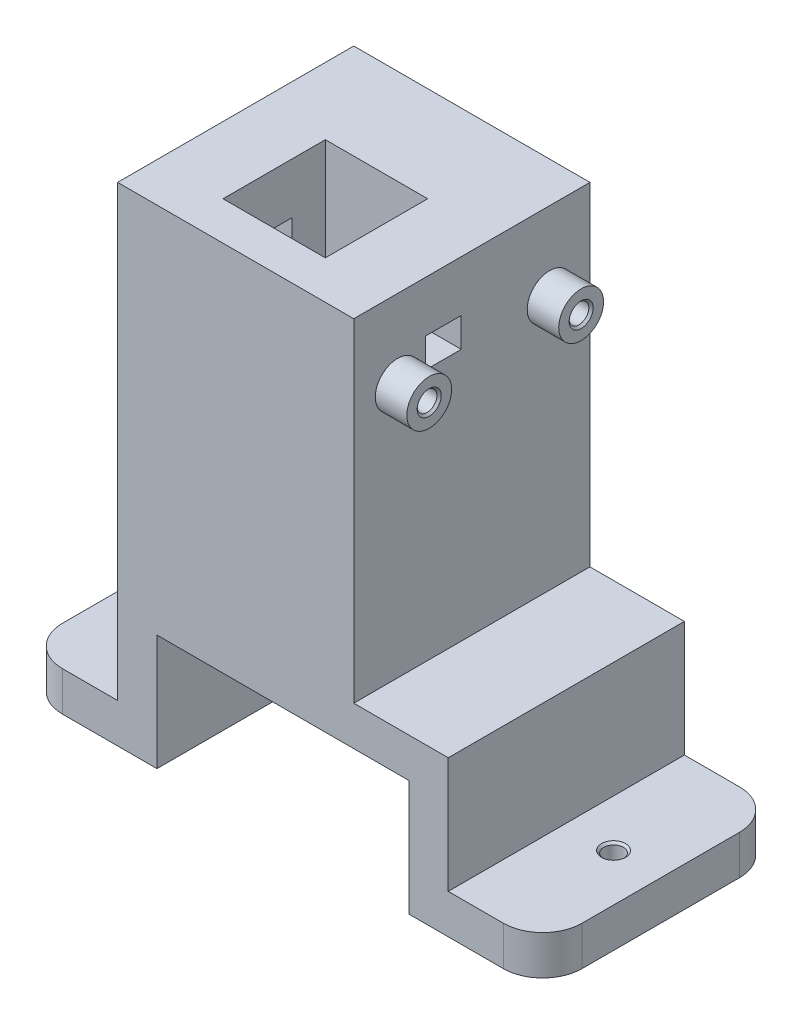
from build123d import *

# Parameters (mm, degrees)
EXTRUDE_1_DEPTH              = 30
SKETCH_2_R                   = 2.85
EXTRUDE_2_DEPTH              = 4
SKETCH_4_W                   = 13
SKETCH_4_H                   = 13
CUT_EXTRUDE_1_DEPTH          = 30
SKETCH_3_W                   = 4.524721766
SKETCH_3_H                   = 3.732895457
CUT_EXTRUDE_2_DEPTH          = 63
HOLE_WIZARD_M3_1_D           = 2.5
HOLE_WIZARD_M3_1_CSINK_D     = 3.05
HOLE_WIZARD_M3_1_CSINK_ANGLE = 90
HOLE_WIZARD_M3_2_D           = 2.5
HOLE_WIZARD_M3_2_DEPTH       = 11.6
HOLE_WIZARD_M3_2_CSINK_D     = 3.05
HOLE_WIZARD_M3_2_CSINK_ANGLE = 90
HOLE_WIZARD_M3_2_TIP         = 0.751075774
FILLET_2_R                   = 5


with BuildPart() as part:
    # Sketch 1 → Extrude 1 (new body)
    with BuildSketch(Plane.XY):
        Polygon((-17.535282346, 24.562850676), (12.464717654, 24.562850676), (12.464717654, -17.737149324), (24.464717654, -17.737149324), (24.464717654, -32.437149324), (36.464717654, -32.437149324), (36.464717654, -37.437149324), (19.464717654, -37.437149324), (19.464717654, -22.737149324), (-12.535282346, -22.737149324), (-12.535282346, -37.437149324), (-29.535282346, -37.437149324), (-29.535282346, -32.437149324), (-17.535282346, -32.437149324), align=None)
    extrude(amount=EXTRUDE_1_DEPTH)

    # Sketch 2 → Extrude 2 (add)
    with BuildSketch(Plane(origin=(12.464717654, 0, 0), x_dir=(0, 0, -1), z_dir=(1, 0, 0))):
        with Locations(Location((-24.417077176, 14.562850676, 0), (0, 0, 270))):
            Circle(SKETCH_2_R)
        with Locations(Location((-5.117077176, 14.562850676, 0), (0, 0, 270))):
            Circle(SKETCH_2_R)
    extrude(amount=EXTRUDE_2_DEPTH)

    # Sketch 4 → Cut-Extrude 1 (cut)
    with BuildSketch(Plane(origin=(0, 24.562850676, 0), x_dir=(1, 0, 0), z_dir=(0, 1, 0))):
        with Locations((-2.535282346, -18.61)):
            Rectangle(SKETCH_4_W, SKETCH_4_H)
    extrude(amount=-CUT_EXTRUDE_1_DEPTH, mode=Mode.SUBTRACT)

    # Sketch 3 → Cut-Extrude 2 (cut)
    with BuildSketch(Plane(origin=(12.464717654, 0, 0), x_dir=(0, 0, -1), z_dir=(1, 0, 0))):
        with Locations((-18.61, 16.232850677)):
            Rectangle(SKETCH_3_W, SKETCH_3_H)
    extrude(amount=-CUT_EXTRUDE_2_DEPTH, mode=Mode.SUBTRACT)

    # Hole Wizard M3 _1 (through all)
    with Locations(Plane(origin=(0, -32.437149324, 0), x_dir=(1, 0, 0), z_dir=(0, 1, 0))):
        with Locations((-23.535282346, -15), (30.464717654, -15)):
            CounterSinkHole(HOLE_WIZARD_M3_1_D / 2, HOLE_WIZARD_M3_1_CSINK_D / 2, counter_sink_angle=HOLE_WIZARD_M3_1_CSINK_ANGLE)

    # Hole Wizard M3 _2
    with Locations(Plane(origin=(16.464717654, 0, 0), x_dir=(0, 0, -1), z_dir=(1, 0, 0))):
        with Locations((-24.417077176, 14.562850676), (-5.117077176, 14.562850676)):
            CounterSinkHole(HOLE_WIZARD_M3_2_D / 2, HOLE_WIZARD_M3_2_CSINK_D / 2, depth=HOLE_WIZARD_M3_2_DEPTH, counter_sink_angle=HOLE_WIZARD_M3_2_CSINK_ANGLE)
            with Locations((0, 0, -(HOLE_WIZARD_M3_2_DEPTH + HOLE_WIZARD_M3_2_TIP / 2))):  # 118° drill point
                Cone(0, HOLE_WIZARD_M3_2_D / 2, HOLE_WIZARD_M3_2_TIP, mode=Mode.SUBTRACT)

    # Fillet 2
    fillet_2_edges = [part.edges().sort_by_distance(p)[0] for p in [
        (-29.535282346, -34.937149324, 30),
        (36.464717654, -34.937149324, 0),
        (-29.535282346, -34.937149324, 0),
        (36.464717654, -34.937149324, 30),
    ]]
    fillet(fillet_2_edges, radius=FILLET_2_R)


solid = part.part
